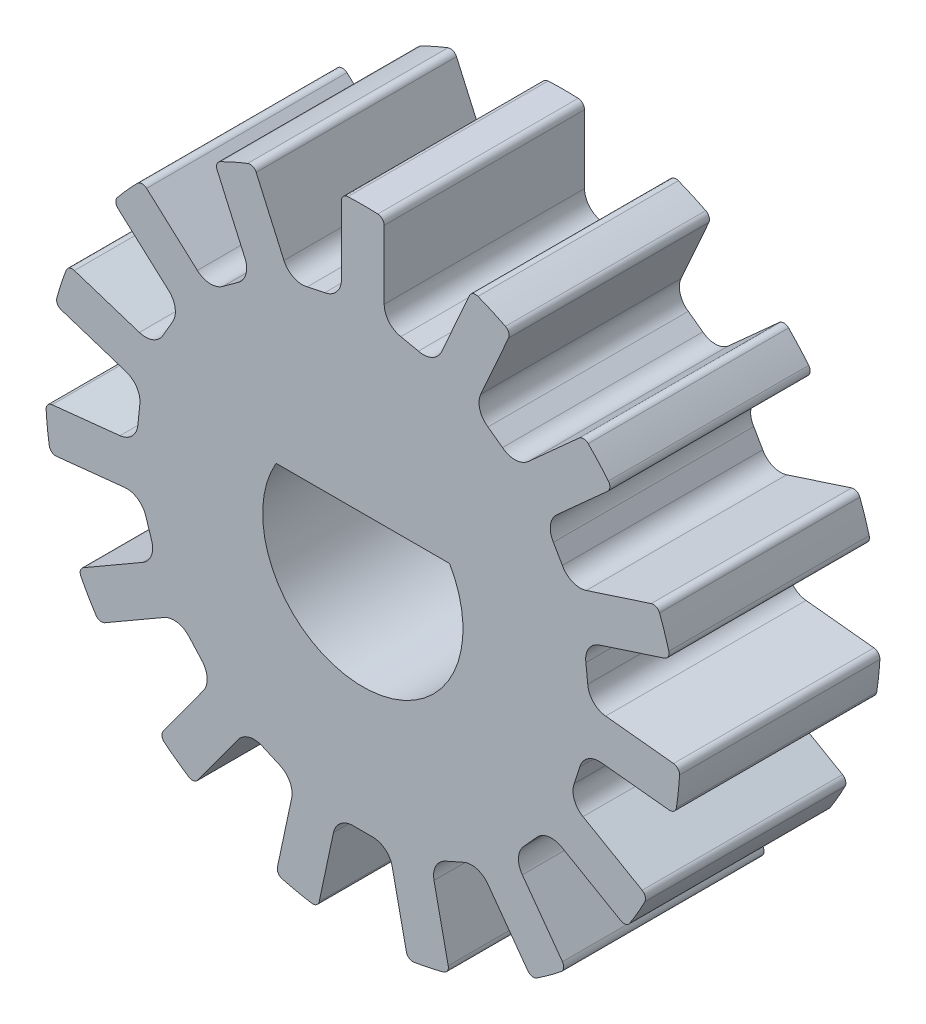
from build123d import *

# Parameters (mm, degrees)
ESQUISSE1_R             = 4.75
EXTRUSION1_DEPTH        = 3
ESQUISSE2_OUTSIDE_W     = 14.254
ESQUISSE2_OUTSIDE_H     = 14.254
ENL_V_MAT_EXTRU_1_DEPTH = 8.356969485
CONG_2_R                = 0.1


with BuildPart() as part:
    # Esquisse1 → Extrusion1 (new body)
    with BuildSketch(Plane.XY):
        Circle(ESQUISSE1_R)
        with BuildLine():
            Line((-1.299038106, 0.75), (1.299038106, 0.75))
            ThreePointArc((1.299038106, 0.75), (0, -1.5), (-1.299038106, 0.75))
        make_face(mode=Mode.SUBTRACT)
    extrude(amount=EXTRUSION1_DEPTH)

    # Esquisse2 outside → Enl_v. mat.-Extru.1 (cut, through all)
    with BuildSketch(Plane.XY.offset(3)):
        Rectangle(ESQUISSE2_OUTSIDE_W, ESQUISSE2_OUTSIDE_H)
        with BuildLine():
            Line((-0.832897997, 3.27061247), (-0.569387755, 3.326623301))
            ThreePointArc((-0.569387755, 3.326623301), (-0.390670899, 3.428911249), (-0.32, 3.62232315))
            Line((-0.32, 3.62232315), (-0.32, 4.739208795))
            ThreePointArc((-0.32, 4.739208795), (0, 4.75), (0.32, 4.739208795))
            Line((0.32, 4.739208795), (0.32, 3.62232315))
            ThreePointArc((0.32, 3.62232315), (0.390670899, 3.428911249), (0.569387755, 3.326623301))
            Line((0.569387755, 3.326623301), (0.832897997, 3.27061247))
            ThreePointArc((0.832897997, 3.27061247), (1.037768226, 3.291366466), (1.180997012, 3.439312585))
            Line((1.180997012, 3.439312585), (1.63527533, 4.459638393))
            ThreePointArc((1.63527533, 4.459638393), (1.931999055, 4.339340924), (2.219944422, 4.199326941))
            Line((2.219944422, 4.199326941), (1.765666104, 3.179001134))
            ThreePointArc((1.765666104, 3.179001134), (1.751559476, 2.973566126), (1.873221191, 2.807430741))
            Line((1.873221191, 2.807430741), (2.091168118, 2.64908303))
            ThreePointArc((2.091168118, 2.64908303), (2.286767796, 2.58471452), (2.477788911, 2.66161363))
            Line((2.477788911, 2.66161363), (3.307796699, 3.408955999))
            ThreePointArc((3.307796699, 3.408955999), (3.529937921, 3.17837038), (3.736040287, 2.93334331))
            Line((3.736040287, 2.93334331), (2.906032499, 2.186000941))
            ThreePointArc((2.906032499, 2.186000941), (2.809587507, 2.004064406), (2.853157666, 1.802807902))
            Line((2.853157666, 1.802807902), (2.987856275, 1.569503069))
            ThreePointArc((2.987856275, 1.569503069), (3.14036444, 1.431141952), (3.346148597, 1.423697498))
            Line((3.346148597, 1.423697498), (4.408369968, 1.768834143))
            ThreePointArc((4.408369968, 1.768834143), (4.517518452, 1.467830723), (4.606140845, 1.160157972))
            Line((4.606140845, 1.160157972), (3.543919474, 0.815021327))
            ThreePointArc((3.543919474, 0.815021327), (3.381812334, 0.688041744), (3.33975726, 0.486463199))
            Line((3.33975726, 0.486463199), (3.367916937, 0.218541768))
            ThreePointArc((3.367916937, 0.218541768), (3.450963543, 0.030111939), (3.635928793, -0.060388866))
            Line((3.635928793, -0.060388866), (4.746696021, -0.177135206))
            ThreePointArc((4.746696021, -0.177135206), (4.723979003, -0.496510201), (4.679797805, -0.813629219))
            Line((4.679797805, -0.813629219), (3.569030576, -0.696882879))
            ThreePointArc((3.569030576, -0.696882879), (3.369291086, -0.746949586), (3.248882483, -0.913995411))
            Line((3.248882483, -0.913995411), (3.165634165, -1.17020739))
            ThreePointArc((3.165634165, -1.17020739), (3.164859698, -1.376124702), (3.297023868, -1.534033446))
            Line((3.297023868, -1.534033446), (4.26427521, -2.092476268))
            ThreePointArc((4.26427521, -2.092476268), (4.113620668, -2.375), (3.94427521, -2.646732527))
            Line((3.94427521, -2.646732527), (2.977023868, -2.088289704))
            ThreePointArc((2.977023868, -2.088289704), (2.7741888, -2.052786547), (2.59624641, -2.156415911))
            Line((2.59624641, -2.156415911), (2.415984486, -2.356617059))
            ThreePointArc((2.415984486, -2.356617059), (2.33152286, -2.54441688), (2.388033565, -2.742429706))
            Line((2.388033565, -2.742429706), (3.044522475, -3.646009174))
            ThreePointArc((3.044522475, -3.646009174), (2.791979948, -3.842830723), (2.526751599, -4.022191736))
            Line((2.526751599, -4.022191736), (1.870262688, -3.118612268))
            ThreePointArc((1.870262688, -3.118612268), (1.699404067, -3.003678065), (1.494695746, -3.025972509))
            Line((1.494695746, -3.025972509), (1.248589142, -3.135546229))
            ThreePointArc((1.248589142, -3.135546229), (1.095044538, -3.272756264), (1.066130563, -3.476634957))
            Line((1.066130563, -3.476634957), (1.298344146, -4.569113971))
            ThreePointArc((1.298344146, -4.569113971), (0.987580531, -4.646201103), (0.672329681, -4.702177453))
            Line((0.672329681, -4.702177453), (0.440116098, -3.609698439))
            ThreePointArc((0.440116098, -3.609698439), (0.330776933, -3.435206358), (0.134698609, -3.372310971))
            Line((0.134698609, -3.372310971), (-0.134698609, -3.372310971))
            ThreePointArc((-0.134698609, -3.372310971), (-0.330776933, -3.435206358), (-0.440116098, -3.609698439))
            Line((-0.440116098, -3.609698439), (-0.672329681, -4.702177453))
            ThreePointArc((-0.672329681, -4.702177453), (-0.987580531, -4.646201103), (-1.298344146, -4.569113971))
            Line((-1.298344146, -4.569113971), (-1.066130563, -3.476634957))
            ThreePointArc((-1.066130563, -3.476634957), (-1.095044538, -3.272756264), (-1.248589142, -3.135546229))
            Line((-1.248589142, -3.135546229), (-1.494695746, -3.025972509))
            ThreePointArc((-1.494695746, -3.025972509), (-1.699404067, -3.003678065), (-1.870262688, -3.118612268))
            Line((-1.870262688, -3.118612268), (-2.526751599, -4.022191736))
            ThreePointArc((-2.526751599, -4.022191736), (-2.791979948, -3.842830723), (-3.044522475, -3.646009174))
            Line((-3.044522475, -3.646009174), (-2.388033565, -2.742429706))
            ThreePointArc((-2.388033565, -2.742429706), (-2.33152286, -2.54441688), (-2.415984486, -2.356617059))
            Line((-2.415984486, -2.356617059), (-2.59624641, -2.156415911))
            ThreePointArc((-2.59624641, -2.156415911), (-2.7741888, -2.052786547), (-2.977023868, -2.088289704))
            Line((-2.977023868, -2.088289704), (-3.94427521, -2.646732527))
            ThreePointArc((-3.94427521, -2.646732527), (-4.113620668, -2.375), (-4.26427521, -2.092476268))
            Line((-4.26427521, -2.092476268), (-3.297023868, -1.534033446))
            ThreePointArc((-3.297023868, -1.534033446), (-3.164859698, -1.376124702), (-3.165634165, -1.17020739))
            Line((-3.165634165, -1.17020739), (-3.248882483, -0.913995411))
            ThreePointArc((-3.248882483, -0.913995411), (-3.369291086, -0.746949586), (-3.569030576, -0.696882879))
            Line((-3.569030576, -0.696882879), (-4.679797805, -0.813629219))
            ThreePointArc((-4.679797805, -0.813629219), (-4.723979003, -0.496510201), (-4.746696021, -0.177135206))
            Line((-4.746696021, -0.177135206), (-3.635928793, -0.060388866))
            ThreePointArc((-3.635928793, -0.060388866), (-3.450963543, 0.030111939), (-3.367916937, 0.218541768))
            Line((-3.367916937, 0.218541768), (-3.33975726, 0.486463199))
            ThreePointArc((-3.33975726, 0.486463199), (-3.381812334, 0.688041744), (-3.543919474, 0.815021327))
            Line((-3.543919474, 0.815021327), (-4.606140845, 1.160157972))
            ThreePointArc((-4.606140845, 1.160157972), (-4.517518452, 1.467830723), (-4.408369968, 1.768834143))
            Line((-4.408369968, 1.768834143), (-3.346148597, 1.423697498))
            ThreePointArc((-3.346148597, 1.423697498), (-3.14036444, 1.431141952), (-2.987856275, 1.569503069))
            Line((-2.987856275, 1.569503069), (-2.853157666, 1.802807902))
            ThreePointArc((-2.853157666, 1.802807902), (-2.809587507, 2.004064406), (-2.906032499, 2.186000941))
            Line((-2.906032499, 2.186000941), (-3.736040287, 2.93334331))
            ThreePointArc((-3.736040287, 2.93334331), (-3.529937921, 3.17837038), (-3.307796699, 3.408955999))
            Line((-3.307796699, 3.408955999), (-2.477788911, 2.66161363))
            ThreePointArc((-2.477788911, 2.66161363), (-2.286767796, 2.58471452), (-2.091168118, 2.64908303))
            Line((-2.091168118, 2.64908303), (-1.873221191, 2.807430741))
            ThreePointArc((-1.873221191, 2.807430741), (-1.751559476, 2.973566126), (-1.765666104, 3.179001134))
            Line((-1.765666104, 3.179001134), (-2.219944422, 4.199326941))
            ThreePointArc((-2.219944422, 4.199326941), (-1.931999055, 4.339340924), (-1.63527533, 4.459638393))
            Line((-1.63527533, 4.459638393), (-1.180997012, 3.439312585))
            ThreePointArc((-1.180997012, 3.439312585), (-1.037768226, 3.291366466), (-0.832897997, 3.27061247))
        make_face(mode=Mode.SUBTRACT)
    extrude(amount=-ENL_V_MAT_EXTRU_1_DEPTH, mode=Mode.SUBTRACT)

    # Cong_2
    cong_2_edges = [part.edges().sort_by_distance(p)[0] for p in [
        (-0.32, 4.739208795, 1.5),
        (0.32, 4.739208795, 1.5),
        (1.63527533, 4.459638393, 1.5),
        (2.219944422, 4.199326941, 1.5),
        (3.307796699, 3.408955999, 1.5),
        (3.736040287, 2.93334331, 1.5),
        (4.408369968, 1.768834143, 1.5),
        (4.606140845, 1.160157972, 1.5),
        (4.746696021, -0.177135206, 1.5),
        (4.679797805, -0.813629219, 1.5),
        (4.26427521, -2.092476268, 1.5),
        (3.94427521, -2.646732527, 1.5),
        (3.044522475, -3.646009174, 1.5),
        (2.526751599, -4.022191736, 1.5),
        (1.298344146, -4.569113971, 1.5),
        (0.672329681, -4.702177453, 1.5),
        (-0.672329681, -4.702177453, 1.5),
        (-1.298344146, -4.569113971, 1.5),
        (-2.526751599, -4.022191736, 1.5),
        (-3.044522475, -3.646009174, 1.5),
        (-3.94427521, -2.646732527, 1.5),
        (-4.26427521, -2.092476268, 1.5),
        (-4.679797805, -0.813629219, 1.5),
        (-4.746696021, -0.177135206, 1.5),
        (-4.606140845, 1.160157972, 1.5),
        (-4.408369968, 1.768834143, 1.5),
        (-3.736040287, 2.93334331, 1.5),
        (-3.307796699, 3.408955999, 1.5),
        (-2.219944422, 4.199326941, 1.5),
        (-1.63527533, 4.459638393, 1.5),
    ]]
    fillet(cong_2_edges, radius=CONG_2_R)


solid = part.part
